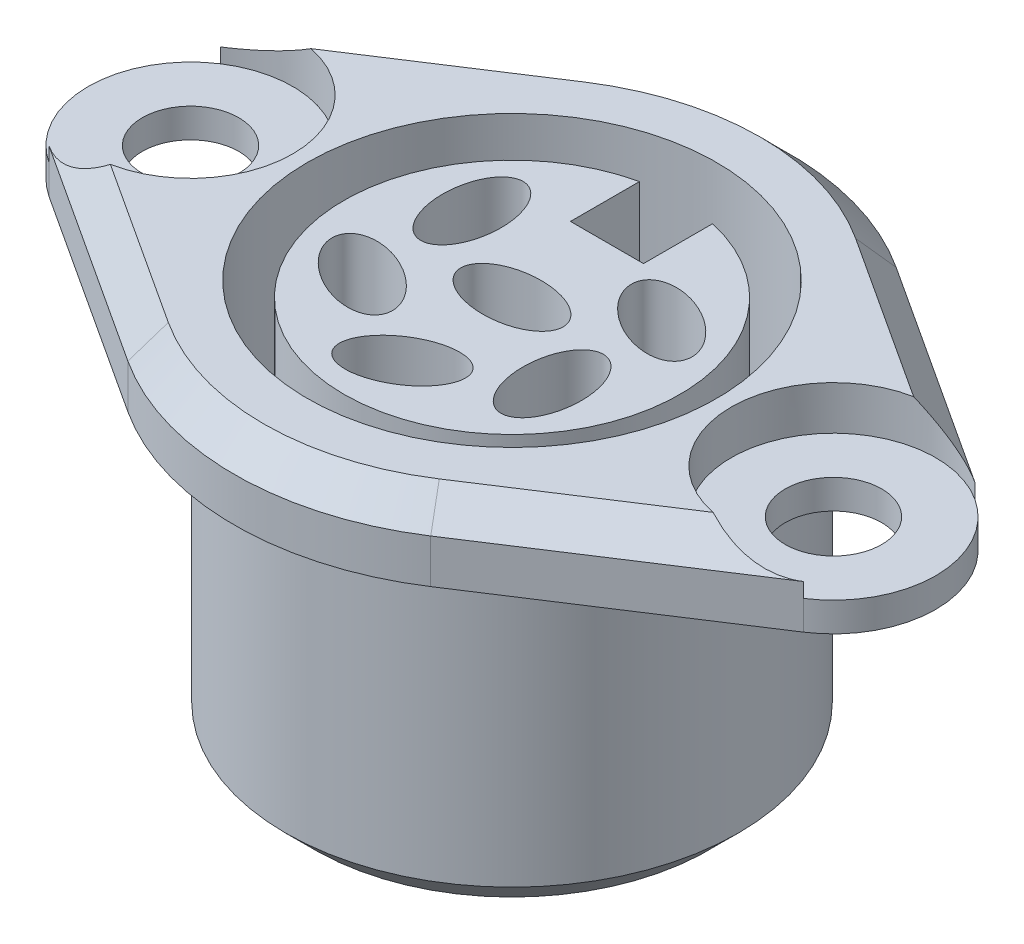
from build123d import *

# Parameters (mm, degrees)
ESQUISSE2_R                  = 17.5
ENL_V_MAT_EXTRU_1_DEPTH      = 25.550967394
ESQUISSE3_R                  = 1.65
ENL_V_MAT_EXTRU_2_DEPTH      = 22.971572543
CHANFREIN1_SIZE              = 1
ESQUISSE4_R                  = 3.5
ENL_V_MAT_EXTRU_3_DEPTH      = 1.5
BOSS_EXTRU_1_DEPTH           = 11.5
ESQUISSE6_RX                 = 1.75
ESQUISSE6_RY                 = 1
ENL_V_MAT_EXTRU_4_DEPTH      = 22.66794868
ESQUISSE7_RX                 = 1.75
ESQUISSE7_RY                 = 1
ENL_V_MAT_EXTRU_5_DEPTH      = 22.66794874
R_P_TITION_CIRCULAIRE1_COUNT = 5
R_P_TITION_CIRCULAIRE1_ANGLE = 240


with BuildPart() as part:
    # Esquisse1 → Base-R_volution (revolve)
    with BuildSketch(Plane.XY, mode=Mode.PRIVATE) as base_r_volution_sk:
        Polygon((0, -12), (7, -12), (7, 0), (14.5, 0), (14.5, -2.5), (7.75, -2.5), (7.75, -13.5), (0, -13.5), align=None)
    revolve(base_r_volution_sk.sketch.rotate(Axis((0, 25.682431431, 0), (0, -1, 0)), 180), axis=Axis((0, 25.682431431, 0), (0, -1, 0)))

    # Esquisse2 → Enl_v. mat.-Extru.1 (cut, through all)
    with BuildSketch(Plane(origin=(0, 0, 0), x_dir=(-1, 0, 0), z_dir=(0, 1, 0))):
        Circle(ESQUISSE2_R)
        with BuildLine():
            Line((-12.909090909, 2.933491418), (-5.181818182, 7.962333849))
            ThreePointArc((-5.181818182, 7.962333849), (0, 9.5), (5.181818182, 7.962333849))
            Line((5.181818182, 7.962333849), (12.909090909, 2.933491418))
            ThreePointArc((12.909090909, 2.933491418), (14.5, 0), (12.909090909, -2.933491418))
            Line((12.909090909, -2.933491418), (5.181818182, -7.962333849))
            ThreePointArc((5.181818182, -7.962333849), (0, -9.5), (-5.181818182, -7.962333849))
            Line((-5.181818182, -7.962333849), (-12.909090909, -2.933491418))
            ThreePointArc((-12.909090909, -2.933491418), (-14.5, 0), (-12.909090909, 2.933491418))
        make_face(mode=Mode.SUBTRACT)
    extrude(amount=-ENL_V_MAT_EXTRU_1_DEPTH, mode=Mode.SUBTRACT)

    # Esquisse3 → Enl_v. mat.-Extru.2 (cut, through all)
    with BuildSketch(Plane(origin=(0, 0, 0), x_dir=(-1, 0, 0), z_dir=(0, 1, 0))):
        with Locations((11, 0)):
            Circle(ESQUISSE3_R)
        with Locations((-11, 0)):
            Circle(ESQUISSE3_R)
    extrude(amount=-ENL_V_MAT_EXTRU_2_DEPTH, mode=Mode.SUBTRACT)

    # Chanfrein1
    chanfrein1_edges = [part.edges().sort_by_distance(p)[0] for p in [
        (-9.045454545, 0, -5.447912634),
        (-9.045454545, 0, 5.447912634),
        (0, 0, -9.5),
        (0, 0, 9.5),
        (9.045454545, 0, -5.447912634),
        (9.045454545, 0, 5.447912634),
        (7.75, -13.5, 0),
    ]]
    chamfer(chanfrein1_edges, length=CHANFREIN1_SIZE)

    # Esquisse4 → Enl_v. mat.-Extru.3 (cut)
    with BuildSketch(Plane(origin=(0, 0, 0), x_dir=(-1, 0, 0), z_dir=(0, 1, 0))):
        with Locations((11, 0)):
            Circle(ESQUISSE4_R)
        with Locations((-11, 0)):
            Circle(ESQUISSE4_R)
    extrude(amount=-ENL_V_MAT_EXTRU_3_DEPTH, mode=Mode.SUBTRACT)

    # Esquisse5 → Boss.-Extru.1 (add)
    with BuildSketch(Plane(origin=(0, -12, 0), x_dir=(-1, 0, 0), z_dir=(0, 1, 0))):
        with BuildLine():
            Line((1.25, -3.25), (1.25, -5.61248608))
            ThreePointArc((1.25, -5.61248608), (0, 5.75), (-1.25, -5.61248608))
            Line((-1.25, -5.61248608), (-1.25, -3.25))
            Line((-1.25, -3.25), (1.25, -3.25))
        make_face()
    extrude(amount=BOSS_EXTRU_1_DEPTH)

    # Esquisse6 → Enl_v. mat.-Extru.4 (cut, through all)
    with BuildSketch(Plane(origin=(0, -0.5, 0), x_dir=(-1, 0, 0), z_dir=(0, 1, 0))):
        with Locations(Location((0, 0), (0, 0, 180))):
            Ellipse(ESQUISSE6_RX, ESQUISSE6_RY)
    extrude(amount=-ENL_V_MAT_EXTRU_4_DEPTH, mode=Mode.SUBTRACT)

    # Esquisse7 → Enl_v. mat.-Extru.5 (cut, through all)
    with BuildSketch(Plane(origin=(0, -0.5, 0), x_dir=(-1, 0, 0), z_dir=(0, 1, 0))):
        with Locations(Location((3.247595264, -1.875), (0, 0, -90))):
            Ellipse(ESQUISSE7_RX, ESQUISSE7_RY)
    enl_v_mat_extru_5 = extrude(amount=-ENL_V_MAT_EXTRU_5_DEPTH, mode=Mode.SUBTRACT)

    # R_p_tition circulaire1: Enl_v. mat.-Extru.5 ×5 about axis
    r_p_tition_circulaire1_axis = Axis((0, 25.682431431, 0), (0, 1, 0))
    for i in range(1, R_P_TITION_CIRCULAIRE1_COUNT):
        add(enl_v_mat_extru_5.rotate(r_p_tition_circulaire1_axis, i * R_P_TITION_CIRCULAIRE1_ANGLE / (R_P_TITION_CIRCULAIRE1_COUNT - 1)), mode=Mode.SUBTRACT)


solid = part.part
